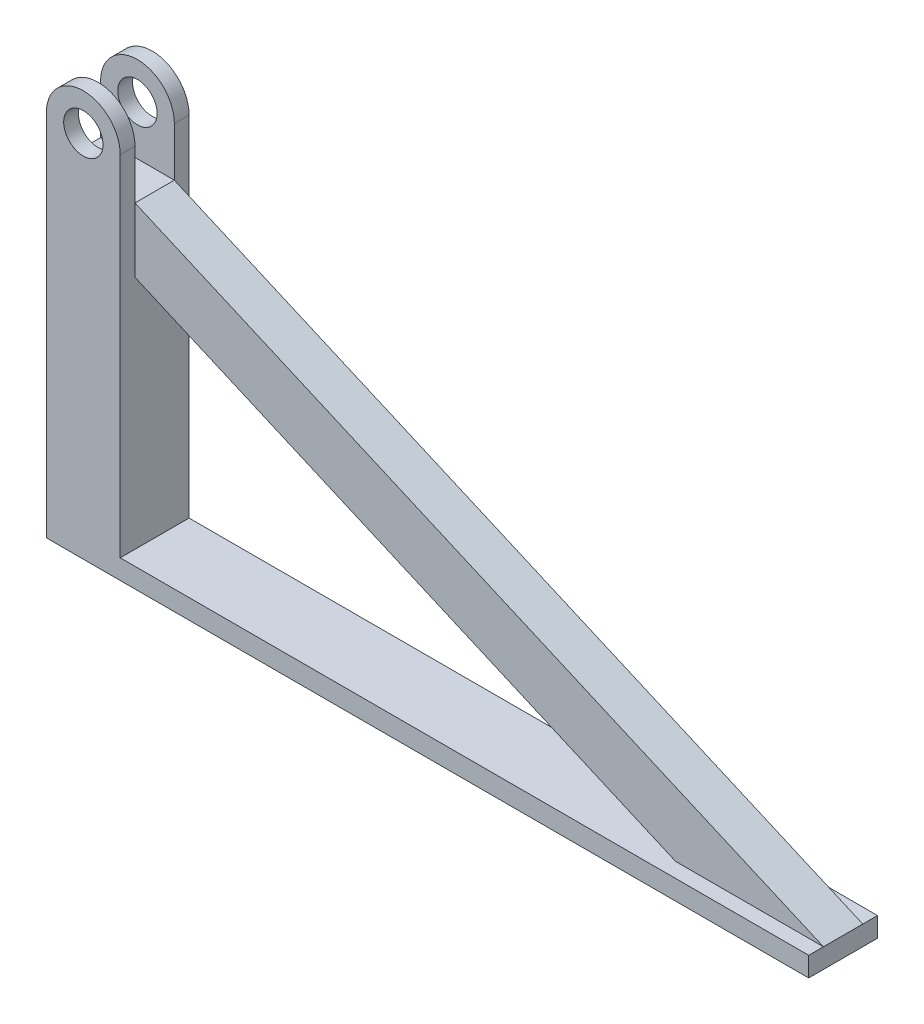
from build123d import *

# Parameters (mm, degrees)
SKETCH1_R             = 20
BOSS_EXTRUDE1_DEPTH   = 5
BOSS_EXTRUDE1_2_DEPTH = 5
BOSS_EXTRUDE2_DEPTH   = 40
BOSS_EXTRUDE3_START   = 40
SKETCH3_3_R           = 75
SKETCH3_3_R_2         = 40
BOSS_EXTRUDE3_DEPTH   = 30
BOSS_EXTRUDE4_START   = -70
SKETCH3_4_R           = 75
SKETCH3_4_R_2         = 40
BOSS_EXTRUDE4_DEPTH   = 30


with BuildPart() as part:
    # Sketch1 → Boss-Extrude1 (new body)
    with BuildSketch(Plane(origin=(0, 0, 0), x_dir=(1, 0, 0), z_dir=(0, 1, 0))):
        with Locations(Location((-700, 0, 0), (0, 0, 270))):
            Circle(SKETCH1_R)
    extrude(amount=-BOSS_EXTRUDE1_DEPTH)



with BuildPart() as body_2:
    # Sketch1 → Boss-Extrude1 2 (new body)
    with BuildSketch(Plane(origin=(0, 0, 0), x_dir=(1, 0, 0), z_dir=(0, 1, 0))):
        with Locations(Location((700, 0, 0), (0, 0, 270))):
            Circle(SKETCH1_R)
    extrude(amount=-BOSS_EXTRUDE1_2_DEPTH)


with BuildPart() as part_1:
    add(part.part)

    add(body_2.part)  # Boss-Extrude2 merges body 2
    # Sketch3 → Boss-Extrude2 (add, symmetric)
    with BuildSketch(Plane.XY):
        Polygon((-775, 0), (775, 0), (775, 40), (474.582660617, 40), (-625, 40), (-625, 519.103873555), (-625, 650), (-775, 650), align=None)
        Polygon((474.582660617, 40), (775, 40), (-625, 650), (-625, 519.103873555), align=None)
    extrude(amount=BOSS_EXTRUDE2_DEPTH, both=True)

    # Sketch3_3 → Boss-Extrude3 (add)
    # profile 1 of 3: a face of its own
    with BuildSketch(Plane.XY.offset(BOSS_EXTRUDE3_START)):
        with BuildLine():
            Line((-775, 750), (-775, 650))
            Line((-775, 650), (-625, 650))
            Line((-625, 650), (-625, 750))
            ThreePointArc((-625, 750), (-700, 675), (-775, 750))
        make_face()
    # profile 2 of 3: a face of its own
    with BuildSketch(Plane.XY.offset(BOSS_EXTRUDE3_START)):
        with Locations((-700, 750)):
            Circle(SKETCH3_3_R)
        with Locations((-700, 750)):
            Circle(SKETCH3_3_R_2, mode=Mode.SUBTRACT)
    # profile 3 of 3: a face of its own
    with BuildSketch(Plane.XY.offset(BOSS_EXTRUDE3_START)):
        Polygon((-775, 0), (775, 0), (775, 40), (474.582660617, 40), (-625, 40), (-625, 519.103873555), (-625, 650), (-775, 650), align=None)
    extrude(amount=BOSS_EXTRUDE3_DEPTH)

    # Sketch3_4 → Boss-Extrude4 (add)
    # profile 1 of 3: a face of its own
    with BuildSketch(Plane.XY.offset(BOSS_EXTRUDE4_START)):
        Polygon((-775, 0), (775, 0), (775, 40), (474.582660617, 40), (-625, 40), (-625, 519.103873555), (-625, 650), (-775, 650), align=None)
    # profile 2 of 3: a face of its own
    with BuildSketch(Plane.XY.offset(BOSS_EXTRUDE4_START)):
        with BuildLine():
            Line((-775, 750), (-775, 650))
            Line((-775, 650), (-625, 650))
            Line((-625, 650), (-625, 750))
            ThreePointArc((-625, 750), (-700, 675), (-775, 750))
        make_face()
    # profile 3 of 3: a face of its own
    with BuildSketch(Plane.XY.offset(BOSS_EXTRUDE4_START)):
        with Locations((-700, 750)):
            Circle(SKETCH3_4_R)
        with Locations((-700, 750)):
            Circle(SKETCH3_4_R_2, mode=Mode.SUBTRACT)
    extrude(amount=BOSS_EXTRUDE4_DEPTH)


solid = part_1.part
